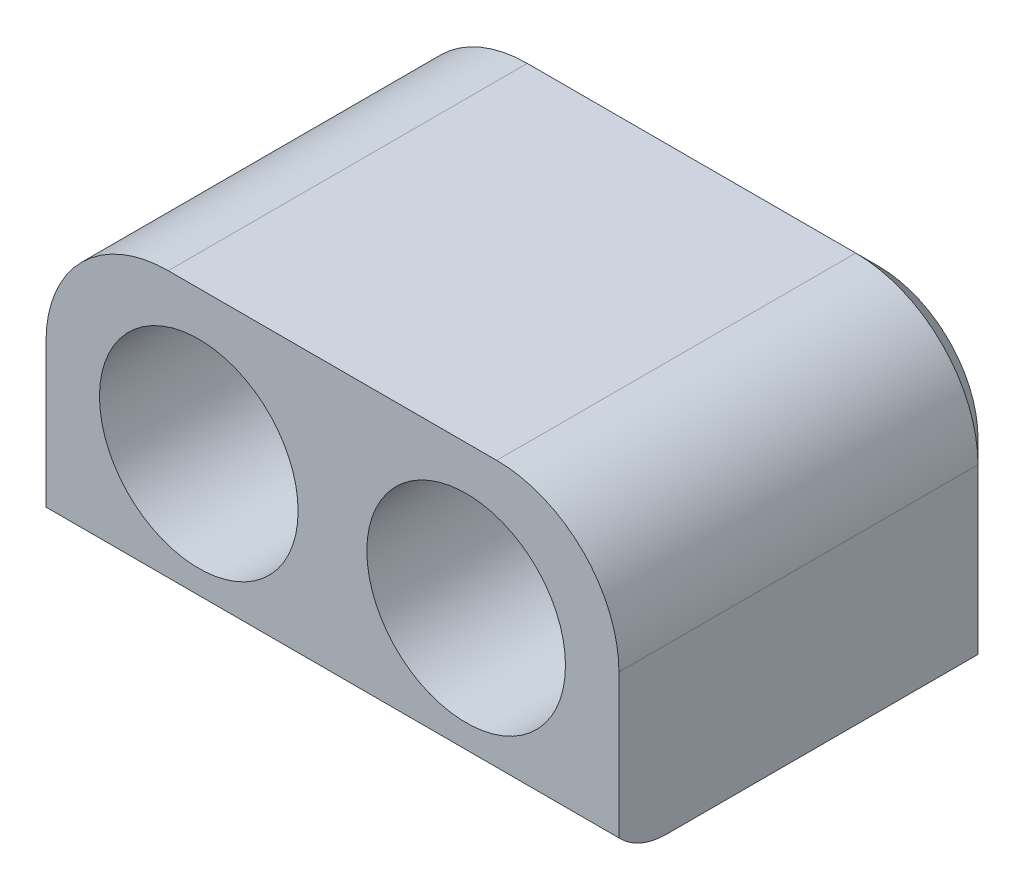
from build123d import *

# Parameters (mm, degrees)
SKETCH3_W             = 19.05
SKETCH3_H             = 9.525
EXTRUDE1_DEPTH        = 12.7
FILLET1_R             = 4.064
F_6_CBORE_D           = 4.318
F_6_CBORE_CBORE_D     = 6.604
F_6_CBORE_CBORE_DEPTH = 4.826
CUT_EXTRUDE1_DEPTH    = 25.797542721
CHAMFER1_SIZE         = 0.762


with BuildPart() as part:
    # Sketch3 → Extrude1 (new body)
    with BuildSketch(Plane.XY):
        with Locations((9.525, 4.7625)):
            Rectangle(SKETCH3_W, SKETCH3_H)
    extrude(amount=-EXTRUDE1_DEPTH)

    # Fillet1
    fillet1_edges = [part.edges().sort_by_distance(p)[0] for p in [
        (0, 9.525, -6.35),
        (19.05, 9.525, -6.35),
    ]]
    fillet(fillet1_edges, radius=FILLET1_R)

    # 6 CBORE (through all)
    with Locations(Plane.XY):
        with Locations((5.08, 4.7625), (13.97, 4.7625)):
            CounterBoreHole(F_6_CBORE_D / 2, F_6_CBORE_CBORE_D / 2, F_6_CBORE_CBORE_DEPTH)

    # Sketch8 → Cut-Extrude1 (cut, through all)
    with BuildSketch(Plane.ZY):
        with BuildLine():
            Line((0, 0.685077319), (1.27, 0.685077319))
            Line((1.27, 0.685077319), (1.27, -1.854922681))
            Line((1.27, -1.854922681), (-1.5748, -1.854922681))
            Line((-1.5748, -1.854922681), (-1.5748, 0))
            ThreePointArc((-1.5748, 0), (-0.716119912, 0.178685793), (0, 0.685077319))
        make_face()
    extrude(amount=-CUT_EXTRUDE1_DEPTH, mode=Mode.SUBTRACT)

    # Chamfer1
    chamfer1_edges = [part.edges().sort_by_distance(p)[0] for p in [
        (19.05, 2.7305, -12.7),
        (9.525, 9.525, -12.7),
        (0, 2.7305, -12.7),
        (17.859681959, 8.334681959, -12.7),
        (1.190318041, 8.334681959, -12.7),
    ]]
    chamfer(chamfer1_edges, length=CHAMFER1_SIZE)


solid = part.part
